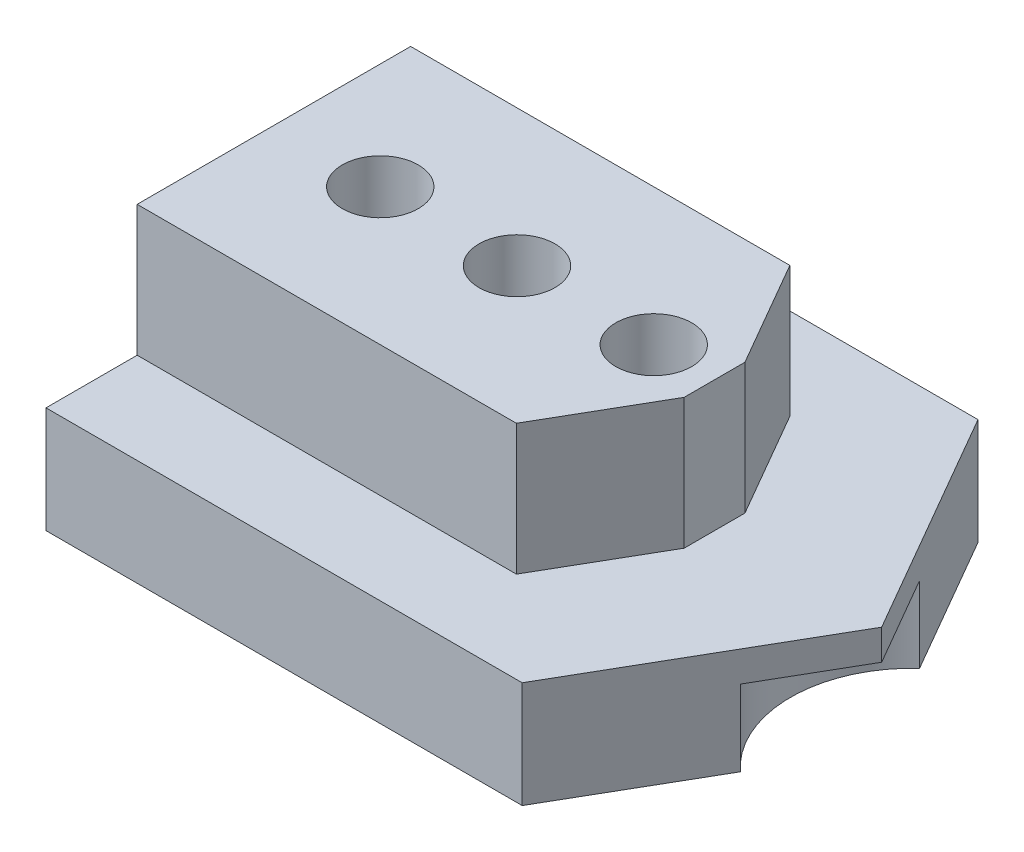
ISO-10303-21;
HEADER;
FILE_DESCRIPTION(('STEP AP214'),'2;1');
FILE_NAME('part.step','',(''),(''),'','','');
FILE_SCHEMA(('AUTOMOTIVE_DESIGN { 1 0 10303 214 1 1 1 1 }'));
ENDSEC;
DATA;
#1=APPLICATION_CONTEXT('core data for automotive mechanical design processes');
#2=APPLICATION_PROTOCOL_DEFINITION('international standard','automotive_design',2000,#1);
#3=PRODUCT_CONTEXT('',#1,'mechanical');
#4=PRODUCT('Part','Part','',(#3));
#5=PRODUCT_RELATED_PRODUCT_CATEGORY('part','',(#4));
#6=PRODUCT_DEFINITION_FORMATION('','',#4);
#7=PRODUCT_DEFINITION_CONTEXT('part definition',#1,'design');
#8=PRODUCT_DEFINITION('design','',#6,#7);
#9=PRODUCT_DEFINITION_SHAPE('','',#8);
#10=(LENGTH_UNIT() NAMED_UNIT(*) SI_UNIT(.MILLI.,.METRE.));
#11=(NAMED_UNIT(*) PLANE_ANGLE_UNIT() SI_UNIT($,.RADIAN.));
#12=(NAMED_UNIT(*) SI_UNIT($,.STERADIAN.) SOLID_ANGLE_UNIT());
#13=UNCERTAINTY_MEASURE_WITH_UNIT(LENGTH_MEASURE(1.E-05),#10,'distance_accuracy_value','');
#14=(GEOMETRIC_REPRESENTATION_CONTEXT(3) GLOBAL_UNCERTAINTY_ASSIGNED_CONTEXT((#13)) GLOBAL_UNIT_ASSIGNED_CONTEXT((#10,
#11,#12)) REPRESENTATION_CONTEXT('',''));
#15=CARTESIAN_POINT('',(0.,0.,0.));
#16=DIRECTION('',(0.,0.,1.));
#17=DIRECTION('',(1.,0.,0.));
#18=AXIS2_PLACEMENT_3D('',#15,#16,#17);
#19=CARTESIAN_POINT('',(0.,3.5,7.49999999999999));
#20=DIRECTION('',(0.,-1.,0.));
#21=DIRECTION('',(0.,0.,-1.));
#22=AXIS2_PLACEMENT_3D('',#19,#20,#21);
#23=PLANE('',#22);
#24=DIRECTION('',(-1.,0.,0.));
#25=VECTOR('',#24,1.);
#26=CARTESIAN_POINT('',(0.,3.50000000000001,-4.50000000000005));
#27=LINE('',#26,#25);
#28=CARTESIAN_POINT('',(12.4792740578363,3.5,-4.50000000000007));
#29=VERTEX_POINT('',#28);
#30=CARTESIAN_POINT('',(0.,3.50000000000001,-4.50000000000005));
#31=VERTEX_POINT('',#30);
#32=EDGE_CURVE('E531',#29,#31,#27,.T.);
#33=ORIENTED_EDGE('',*,*,#32,.F.);
#34=DIRECTION('',(-0.500000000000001,0.,-0.866025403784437));
#35=VECTOR('',#34,1.);
#36=CARTESIAN_POINT('',(12.4792740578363,3.5,-4.50000000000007));
#37=LINE('',#36,#35);
#38=CARTESIAN_POINT('',(14.5,3.5,-1.00000000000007));
#39=VERTEX_POINT('',#38);
#40=EDGE_CURVE('E528',#39,#29,#37,.T.);
#41=ORIENTED_EDGE('',*,*,#40,.F.);
#42=DIRECTION('',(0.,0.,-1.));
#43=VECTOR('',#42,1.);
#44=CARTESIAN_POINT('',(14.5,3.5,-1.00000000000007));
#45=LINE('',#44,#43);
#46=CARTESIAN_POINT('',(14.5,3.5,0.999999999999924));
#47=VERTEX_POINT('',#46);
#48=EDGE_CURVE('E525',#47,#39,#45,.T.);
#49=ORIENTED_EDGE('',*,*,#48,.F.);
#50=DIRECTION('',(0.500000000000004,0.,-0.86602540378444));
#51=VECTOR('',#50,1.);
#52=CARTESIAN_POINT('',(14.5,3.5,0.999999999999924));
#53=LINE('',#52,#51);
#54=CARTESIAN_POINT('',(12.4792740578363,3.5,4.49999999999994));
#55=VERTEX_POINT('',#54);
#56=EDGE_CURVE('E522',#55,#47,#53,.T.);
#57=ORIENTED_EDGE('',*,*,#56,.F.);
#58=DIRECTION('',(1.,0.,0.));
#59=VECTOR('',#58,1.);
#60=CARTESIAN_POINT('',(0.,3.5,4.49999999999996));
#61=LINE('',#60,#59);
#62=CARTESIAN_POINT('',(0.,3.5,4.49999999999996));
#63=VERTEX_POINT('',#62);
#64=EDGE_CURVE('E521',#63,#55,#61,.T.);
#65=ORIENTED_EDGE('',*,*,#64,.F.);
#66=DIRECTION('',(0.,0.,1.));
#67=VECTOR('',#66,1.);
#68=CARTESIAN_POINT('',(0.,3.5,7.49999999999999));
#69=LINE('',#68,#67);
#70=CARTESIAN_POINT('',(0.,3.5,7.49999999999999));
#71=VERTEX_POINT('',#70);
#72=EDGE_CURVE('E594',#63,#71,#69,.T.);
#73=ORIENTED_EDGE('',*,*,#72,.T.);
#74=DIRECTION('',(1.,0.,0.));
#75=VECTOR('',#74,1.);
#76=CARTESIAN_POINT('',(15.6698729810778,3.49999999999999,7.49999999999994));
#77=LINE('',#76,#75);
#78=CARTESIAN_POINT('',(15.6698729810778,3.49999999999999,7.49999999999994));
#79=VERTEX_POINT('',#78);
#80=EDGE_CURVE('E585',#71,#79,#77,.T.);
#81=ORIENTED_EDGE('',*,*,#80,.T.);
#82=DIRECTION('',(0.500000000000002,0.,-0.866025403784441));
#83=VECTOR('',#82,1.);
#84=CARTESIAN_POINT('',(20.,3.5,0.));
#85=LINE('',#84,#83);
#86=CARTESIAN_POINT('',(20.,3.5,0.));
#87=VERTEX_POINT('',#86);
#88=EDGE_CURVE('E588',#79,#87,#85,.T.);
#89=ORIENTED_EDGE('',*,*,#88,.T.);
#90=DIRECTION('',(-0.499999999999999,0.,-0.866025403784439));
#91=VECTOR('',#90,1.);
#92=CARTESIAN_POINT('',(15.6698729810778,3.5,-7.50000000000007));
#93=LINE('',#92,#91);
#94=CARTESIAN_POINT('',(15.6698729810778,3.5,-7.50000000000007));
#95=VERTEX_POINT('',#94);
#96=EDGE_CURVE('E590',#87,#95,#93,.T.);
#97=ORIENTED_EDGE('',*,*,#96,.T.);
#98=DIRECTION('',(-1.,0.,0.));
#99=VECTOR('',#98,1.);
#100=CARTESIAN_POINT('',(0.,3.50000000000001,-7.50000000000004));
#101=LINE('',#100,#99);
#102=CARTESIAN_POINT('',(0.,3.50000000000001,-7.50000000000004));
#103=VERTEX_POINT('',#102);
#104=EDGE_CURVE('E592',#95,#103,#101,.T.);
#105=ORIENTED_EDGE('',*,*,#104,.T.);
#106=EDGE_CURVE('E603',#103,#31,#69,.T.);
#107=ORIENTED_EDGE('',*,*,#106,.T.);
#108=EDGE_LOOP('',(#33,#41,#49,#57,#65,#73,#81,#89,#97,#105,#107));
#109=FACE_BOUND('',#108,.T.);
#110=ADVANCED_FACE('F350',(#109),#23,.F.);
#111=CARTESIAN_POINT('',(15.6698729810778,3.49999999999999,7.49999999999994));
#112=DIRECTION('',(0.,0.,-1.));
#113=DIRECTION('',(-1.,0.,0.));
#114=AXIS2_PLACEMENT_3D('',#111,#112,#113);
#115=PLANE('',#114);
#116=DIRECTION('',(1.,0.,0.));
#117=VECTOR('',#116,1.);
#118=CARTESIAN_POINT('',(15.6698729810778,0.,7.49999999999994));
#119=LINE('',#118,#117);
#120=CARTESIAN_POINT('',(0.,0.,7.5));
#121=VERTEX_POINT('',#120);
#122=CARTESIAN_POINT('',(15.6698729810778,0.,7.49999999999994));
#123=VERTEX_POINT('',#122);
#124=EDGE_CURVE('E573',#121,#123,#119,.T.);
#125=ORIENTED_EDGE('',*,*,#124,.T.);
#126=DIRECTION('',(0.,-1.,0.));
#127=VECTOR('',#126,1.);
#128=CARTESIAN_POINT('',(15.6698729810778,3.49999999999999,7.49999999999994));
#129=LINE('',#128,#127);
#130=EDGE_CURVE('E359',#79,#123,#129,.T.);
#131=ORIENTED_EDGE('',*,*,#130,.F.);
#132=ORIENTED_EDGE('',*,*,#80,.F.);
#133=DIRECTION('',(0.,-1.,0.));
#134=VECTOR('',#133,1.);
#135=CARTESIAN_POINT('',(0.,3.5,7.49999999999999));
#136=LINE('',#135,#134);
#137=EDGE_CURVE('E597',#71,#121,#136,.T.);
#138=ORIENTED_EDGE('',*,*,#137,.T.);
#139=EDGE_LOOP('',(#125,#131,#132,#138));
#140=FACE_BOUND('',#139,.T.);
#141=ADVANCED_FACE('F352',(#140),#115,.F.);
#142=CARTESIAN_POINT('',(20.,3.5,0.));
#143=DIRECTION('',(-0.86602540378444,0.,-0.499999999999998));
#144=DIRECTION('',(-0.500000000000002,0.,0.866025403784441));
#145=AXIS2_PLACEMENT_3D('',#142,#143,#144);
#146=PLANE('',#145);
#147=DIRECTION('',(0.500000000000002,0.,-0.866025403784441));
#148=VECTOR('',#147,1.);
#149=CARTESIAN_POINT('',(20.,0.,0.));
#150=LINE('',#149,#148);
#151=CARTESIAN_POINT('',(18.2974375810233,0.,2.9489246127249));
#152=VERTEX_POINT('',#151);
#153=EDGE_CURVE('E576',#123,#152,#150,.T.);
#154=ORIENTED_EDGE('',*,*,#153,.T.);
#155=DIRECTION('',(0.,-1.,0.));
#156=VECTOR('',#155,1.);
#157=CARTESIAN_POINT('',(18.2974375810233,2.5,2.9489246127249));
#158=LINE('',#157,#156);
#159=CARTESIAN_POINT('',(18.2974375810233,2.5,2.9489246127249));
#160=VERTEX_POINT('',#159);
#161=EDGE_CURVE('E374',#152,#160,#158,.F.);
#162=ORIENTED_EDGE('',*,*,#161,.T.);
#163=DIRECTION('',(-0.500000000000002,0.,0.866025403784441));
#164=VECTOR('',#163,1.);
#165=CARTESIAN_POINT('',(20.,2.5,0.));
#166=LINE('',#165,#164);
#167=CARTESIAN_POINT('',(20.,2.5,0.));
#168=VERTEX_POINT('',#167);
#169=EDGE_CURVE('E519',#168,#160,#166,.T.);
#170=ORIENTED_EDGE('',*,*,#169,.F.);
#171=DIRECTION('',(0.,-1.,0.));
#172=VECTOR('',#171,1.);
#173=CARTESIAN_POINT('',(20.,3.5,0.));
#174=LINE('',#173,#172);
#175=EDGE_CURVE('E607',#87,#168,#174,.T.);
#176=ORIENTED_EDGE('',*,*,#175,.F.);
#177=ORIENTED_EDGE('',*,*,#88,.F.);
#178=ORIENTED_EDGE('',*,*,#130,.T.);
#179=EDGE_LOOP('',(#154,#162,#170,#176,#177,#178));
#180=FACE_BOUND('',#179,.T.);
#181=ADVANCED_FACE('F626',(#180),#146,.F.);
#182=CARTESIAN_POINT('',(15.6698729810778,3.5,-7.50000000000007));
#183=DIRECTION('',(-0.866025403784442,0.,0.500000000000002));
#184=DIRECTION('',(0.499999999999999,0.,0.866025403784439));
#185=AXIS2_PLACEMENT_3D('',#182,#183,#184);
#186=PLANE('',#185);
#187=DIRECTION('',(0.499999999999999,0.,0.866025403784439));
#188=VECTOR('',#187,1.);
#189=CARTESIAN_POINT('',(15.6698729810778,2.5,-7.50000000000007));
#190=LINE('',#189,#188);
#191=CARTESIAN_POINT('',(18.2974375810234,2.5,-2.94892461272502));
#192=VERTEX_POINT('',#191);
#193=EDGE_CURVE('E11',#192,#168,#190,.T.);
#194=ORIENTED_EDGE('',*,*,#193,.F.);
#195=DIRECTION('',(0.,-1.,0.));
#196=VECTOR('',#195,1.);
#197=CARTESIAN_POINT('',(18.2974375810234,2.5,-2.94892461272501));
#198=LINE('',#197,#196);
#199=CARTESIAN_POINT('',(18.2974375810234,0.,-2.94892461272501));
#200=VERTEX_POINT('',#199);
#201=EDGE_CURVE('E515',#192,#200,#198,.T.);
#202=ORIENTED_EDGE('',*,*,#201,.T.);
#203=DIRECTION('',(-0.499999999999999,0.,-0.866025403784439));
#204=VECTOR('',#203,1.);
#205=CARTESIAN_POINT('',(15.6698729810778,0.,-7.50000000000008));
#206=LINE('',#205,#204);
#207=CARTESIAN_POINT('',(15.6698729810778,0.,-7.50000000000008));
#208=VERTEX_POINT('',#207);
#209=EDGE_CURVE('E579',#200,#208,#206,.T.);
#210=ORIENTED_EDGE('',*,*,#209,.T.);
#211=DIRECTION('',(0.,-1.,0.));
#212=VECTOR('',#211,1.);
#213=CARTESIAN_POINT('',(15.6698729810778,3.5,-7.50000000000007));
#214=LINE('',#213,#212);
#215=EDGE_CURVE('E610',#95,#208,#214,.T.);
#216=ORIENTED_EDGE('',*,*,#215,.F.);
#217=ORIENTED_EDGE('',*,*,#96,.F.);
#218=ORIENTED_EDGE('',*,*,#175,.T.);
#219=EDGE_LOOP('',(#194,#202,#210,#216,#217,#218));
#220=FACE_BOUND('',#219,.T.);
#221=ADVANCED_FACE('F676',(#220),#186,.F.);
#222=CARTESIAN_POINT('',(0.,3.50000000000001,-7.50000000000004));
#223=DIRECTION('',(0.,0.,1.));
#224=DIRECTION('',(1.,0.,0.));
#225=AXIS2_PLACEMENT_3D('',#222,#223,#224);
#226=PLANE('',#225);
#227=DIRECTION('',(-1.,0.,0.));
#228=VECTOR('',#227,1.);
#229=CARTESIAN_POINT('',(0.,0.,-7.50000000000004));
#230=LINE('',#229,#228);
#231=CARTESIAN_POINT('',(0.,0.,-7.50000000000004));
#232=VERTEX_POINT('',#231);
#233=EDGE_CURVE('E581',#208,#232,#230,.T.);
#234=ORIENTED_EDGE('',*,*,#233,.T.);
#235=DIRECTION('',(0.,-1.,0.));
#236=VECTOR('',#235,1.);
#237=CARTESIAN_POINT('',(0.,3.50000000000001,-7.50000000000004));
#238=LINE('',#237,#236);
#239=EDGE_CURVE('E612',#103,#232,#238,.T.);
#240=ORIENTED_EDGE('',*,*,#239,.F.);
#241=ORIENTED_EDGE('',*,*,#104,.F.);
#242=ORIENTED_EDGE('',*,*,#215,.T.);
#243=EDGE_LOOP('',(#234,#240,#241,#242));
#244=FACE_BOUND('',#243,.T.);
#245=ADVANCED_FACE('F673',(#244),#226,.F.);
#246=CARTESIAN_POINT('',(0.,3.5,7.49999999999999));
#247=DIRECTION('',(1.,0.,0.));
#248=DIRECTION('',(0.,0.,-1.));
#249=AXIS2_PLACEMENT_3D('',#246,#247,#248);
#250=PLANE('',#249);
#251=DIRECTION('',(0.,0.,1.));
#252=VECTOR('',#251,1.);
#253=CARTESIAN_POINT('',(0.,0.,7.5));
#254=LINE('',#253,#252);
#255=EDGE_CURVE('E583',#232,#121,#254,.T.);
#256=ORIENTED_EDGE('',*,*,#255,.T.);
#257=ORIENTED_EDGE('',*,*,#137,.F.);
#258=ORIENTED_EDGE('',*,*,#72,.F.);
#259=DIRECTION('',(0.,-1.,0.));
#260=VECTOR('',#259,1.);
#261=CARTESIAN_POINT('',(0.,7.8,4.49999999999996));
#262=LINE('',#261,#260);
#263=CARTESIAN_POINT('',(0.,7.8,4.49999999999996));
#264=VERTEX_POINT('',#263);
#265=EDGE_CURVE('E572',#264,#63,#262,.T.);
#266=ORIENTED_EDGE('',*,*,#265,.F.);
#267=DIRECTION('',(0.,0.,1.));
#268=VECTOR('',#267,1.);
#269=CARTESIAN_POINT('',(0.,7.8,-4.50000000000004));
#270=LINE('',#269,#268);
#271=CARTESIAN_POINT('',(0.,7.8,-4.50000000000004));
#272=VERTEX_POINT('',#271);
#273=EDGE_CURVE('E534',#272,#264,#270,.T.);
#274=ORIENTED_EDGE('',*,*,#273,.F.);
#275=DIRECTION('',(0.,-1.,0.));
#276=VECTOR('',#275,1.);
#277=CARTESIAN_POINT('',(0.,7.8,-4.50000000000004));
#278=LINE('',#277,#276);
#279=EDGE_CURVE('E542',#272,#31,#278,.T.);
#280=ORIENTED_EDGE('',*,*,#279,.T.);
#281=ORIENTED_EDGE('',*,*,#106,.F.);
#282=ORIENTED_EDGE('',*,*,#239,.T.);
#283=EDGE_LOOP('',(#256,#257,#258,#266,#274,#280,#281,#282));
#284=FACE_BOUND('',#283,.T.);
#285=ADVANCED_FACE('F634',(#284),#250,.F.);
#286=CARTESIAN_POINT('',(0.,0.,7.5));
#287=DIRECTION('',(0.,-1.,0.));
#288=DIRECTION('',(0.,0.,-1.));
#289=AXIS2_PLACEMENT_3D('',#286,#287,#288);
#290=PLANE('',#289);
#291=CARTESIAN_POINT('',(12.5,0.,0.));
#292=DIRECTION('',(0.,1.,0.));
#293=DIRECTION('',(0.,0.,1.));
#294=AXIS2_PLACEMENT_3D('',#291,#292,#293);
#295=CIRCLE('',#294,1.25);
#296=CARTESIAN_POINT('',(12.5,0.,1.24999999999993));
#297=VERTEX_POINT('',#296);
#298=EDGE_CURVE('E702',#297,#297,#295,.T.);
#299=ORIENTED_EDGE('',*,*,#298,.T.);
#300=EDGE_LOOP('',(#299));
#301=FACE_BOUND('',#300,.T.);
#302=CARTESIAN_POINT('',(3.50000000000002,0.,0.));
#303=DIRECTION('',(0.,1.,0.));
#304=DIRECTION('',(0.,0.,1.));
#305=AXIS2_PLACEMENT_3D('',#302,#303,#304);
#306=CIRCLE('',#305,1.25);
#307=CARTESIAN_POINT('',(3.50000000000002,0.,1.24999999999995));
#308=VERTEX_POINT('',#307);
#309=EDGE_CURVE('E705',#308,#308,#306,.T.);
#310=ORIENTED_EDGE('',*,*,#309,.T.);
#311=EDGE_LOOP('',(#310));
#312=FACE_BOUND('',#311,.T.);
#313=CARTESIAN_POINT('',(8.20000000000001,0.,3.39999999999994));
#314=DIRECTION('',(0.,-1.,0.));
#315=DIRECTION('',(0.,0.,-1.));
#316=AXIS2_PLACEMENT_3D('',#313,#314,#315);
#317=CIRCLE('',#316,2.);
#318=CARTESIAN_POINT('',(10.2,0.,3.39999999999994));
#319=VERTEX_POINT('',#318);
#320=CARTESIAN_POINT('',(6.2,0.,3.39999999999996));
#321=VERTEX_POINT('',#320);
#322=EDGE_CURVE('E366',#319,#321,#317,.T.);
#323=ORIENTED_EDGE('',*,*,#322,.F.);
#324=DIRECTION('',(0.,0.,1.));
#325=VECTOR('',#324,1.);
#326=CARTESIAN_POINT('',(10.2,0.,3.39999999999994));
#327=LINE('',#326,#325);
#328=CARTESIAN_POINT('',(10.2,0.,-3.40000000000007));
#329=VERTEX_POINT('',#328);
#330=EDGE_CURVE('E492',#329,#319,#327,.T.);
#331=ORIENTED_EDGE('',*,*,#330,.F.);
#332=CARTESIAN_POINT('',(8.2,0.,-3.40000000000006));
#333=DIRECTION('',(0.,-1.,0.));
#334=DIRECTION('',(0.,0.,1.));
#335=AXIS2_PLACEMENT_3D('',#332,#333,#334);
#336=CIRCLE('',#335,2.);
#337=CARTESIAN_POINT('',(6.19999999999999,0.,-3.40000000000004));
#338=VERTEX_POINT('',#337);
#339=EDGE_CURVE('E474',#338,#329,#336,.T.);
#340=ORIENTED_EDGE('',*,*,#339,.F.);
#341=DIRECTION('',(0.,0.,-1.));
#342=VECTOR('',#341,1.);
#343=CARTESIAN_POINT('',(6.2,0.,-3.40000000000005));
#344=LINE('',#343,#342);
#345=EDGE_CURVE('E485',#321,#338,#344,.T.);
#346=ORIENTED_EDGE('',*,*,#345,.F.);
#347=EDGE_LOOP('',(#323,#331,#340,#346));
#348=FACE_BOUND('',#347,.T.);
#349=CARTESIAN_POINT('',(21.,0.,0.));
#350=DIRECTION('',(0.,-1.,0.));
#351=DIRECTION('',(0.,0.,-1.));
#352=AXIS2_PLACEMENT_3D('',#349,#350,#351);
#353=CIRCLE('',#352,4.);
#354=EDGE_CURVE('E508',#152,#200,#353,.T.);
#355=ORIENTED_EDGE('',*,*,#354,.F.);
#356=ORIENTED_EDGE('',*,*,#153,.F.);
#357=ORIENTED_EDGE('',*,*,#124,.F.);
#358=ORIENTED_EDGE('',*,*,#255,.F.);
#359=ORIENTED_EDGE('',*,*,#233,.F.);
#360=ORIENTED_EDGE('',*,*,#209,.F.);
#361=EDGE_LOOP('',(#355,#356,#357,#358,#359,#360));
#362=FACE_BOUND('',#361,.T.);
#363=ADVANCED_FACE('F489',(#301,#312,#348,#362),#290,.T.);
#364=CARTESIAN_POINT('',(0.,7.8,4.49999999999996));
#365=DIRECTION('',(0.,0.,-1.));
#366=DIRECTION('',(-1.,0.,0.));
#367=AXIS2_PLACEMENT_3D('',#364,#365,#366);
#368=PLANE('',#367);
#369=ORIENTED_EDGE('',*,*,#64,.T.);
#370=DIRECTION('',(0.,-1.,0.));
#371=VECTOR('',#370,1.);
#372=CARTESIAN_POINT('',(12.4792740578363,7.8,4.49999999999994));
#373=LINE('',#372,#371);
#374=CARTESIAN_POINT('',(12.4792740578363,7.8,4.49999999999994));
#375=VERTEX_POINT('',#374);
#376=EDGE_CURVE('E569',#375,#55,#373,.T.);
#377=ORIENTED_EDGE('',*,*,#376,.F.);
#378=DIRECTION('',(1.,0.,0.));
#379=VECTOR('',#378,1.);
#380=CARTESIAN_POINT('',(0.,7.8,4.49999999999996));
#381=LINE('',#380,#379);
#382=EDGE_CURVE('E638',#264,#375,#381,.T.);
#383=ORIENTED_EDGE('',*,*,#382,.F.);
#384=ORIENTED_EDGE('',*,*,#265,.T.);
#385=EDGE_LOOP('',(#369,#377,#383,#384));
#386=FACE_BOUND('',#385,.T.);
#387=ADVANCED_FACE('F636',(#386),#368,.F.);
#388=CARTESIAN_POINT('',(14.5,7.8,0.99999999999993));
#389=DIRECTION('',(-0.866025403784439,0.,-0.5));
#390=DIRECTION('',(-0.500000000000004,0.,0.86602540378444));
#391=AXIS2_PLACEMENT_3D('',#388,#389,#390);
#392=PLANE('',#391);
#393=ORIENTED_EDGE('',*,*,#56,.T.);
#394=DIRECTION('',(0.,-1.,0.));
#395=VECTOR('',#394,1.);
#396=CARTESIAN_POINT('',(14.5,7.8,0.99999999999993));
#397=LINE('',#396,#395);
#398=CARTESIAN_POINT('',(14.5,7.8,0.99999999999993));
#399=VERTEX_POINT('',#398);
#400=EDGE_CURVE('E566',#399,#47,#397,.T.);
#401=ORIENTED_EDGE('',*,*,#400,.F.);
#402=DIRECTION('',(0.500000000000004,0.,-0.86602540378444));
#403=VECTOR('',#402,1.);
#404=CARTESIAN_POINT('',(14.5,7.8,0.99999999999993));
#405=LINE('',#404,#403);
#406=EDGE_CURVE('E642',#375,#399,#405,.T.);
#407=ORIENTED_EDGE('',*,*,#406,.F.);
#408=ORIENTED_EDGE('',*,*,#376,.T.);
#409=EDGE_LOOP('',(#393,#401,#407,#408));
#410=FACE_BOUND('',#409,.T.);
#411=ADVANCED_FACE('F698',(#410),#392,.F.);
#412=CARTESIAN_POINT('',(14.5,7.8,-1.00000000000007));
#413=DIRECTION('',(-1.,0.,0.));
#414=DIRECTION('',(0.,0.,1.));
#415=AXIS2_PLACEMENT_3D('',#412,#413,#414);
#416=PLANE('',#415);
#417=ORIENTED_EDGE('',*,*,#48,.T.);
#418=DIRECTION('',(0.,-1.,0.));
#419=VECTOR('',#418,1.);
#420=CARTESIAN_POINT('',(14.5,7.8,-1.00000000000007));
#421=LINE('',#420,#419);
#422=CARTESIAN_POINT('',(14.5,7.8,-1.00000000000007));
#423=VERTEX_POINT('',#422);
#424=EDGE_CURVE('E553',#423,#39,#421,.T.);
#425=ORIENTED_EDGE('',*,*,#424,.F.);
#426=DIRECTION('',(0.,0.,-1.));
#427=VECTOR('',#426,1.);
#428=CARTESIAN_POINT('',(14.5,7.8,-1.00000000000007));
#429=LINE('',#428,#427);
#430=EDGE_CURVE('E560',#399,#423,#429,.T.);
#431=ORIENTED_EDGE('',*,*,#430,.F.);
#432=ORIENTED_EDGE('',*,*,#400,.T.);
#433=EDGE_LOOP('',(#417,#425,#431,#432));
#434=FACE_BOUND('',#433,.T.);
#435=ADVANCED_FACE('F756',(#434),#416,.F.);
#436=CARTESIAN_POINT('',(12.4792740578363,7.8,-4.50000000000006));
#437=DIRECTION('',(-0.866025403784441,0.,0.500000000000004));
#438=DIRECTION('',(0.500000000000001,0.,0.866025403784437));
#439=AXIS2_PLACEMENT_3D('',#436,#437,#438);
#440=PLANE('',#439);
#441=ORIENTED_EDGE('',*,*,#40,.T.);
#442=DIRECTION('',(0.,-1.,0.));
#443=VECTOR('',#442,1.);
#444=CARTESIAN_POINT('',(12.4792740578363,7.8,-4.50000000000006));
#445=LINE('',#444,#443);
#446=CARTESIAN_POINT('',(12.4792740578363,7.8,-4.50000000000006));
#447=VERTEX_POINT('',#446);
#448=EDGE_CURVE('E545',#447,#29,#445,.T.);
#449=ORIENTED_EDGE('',*,*,#448,.F.);
#450=DIRECTION('',(-0.500000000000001,0.,-0.866025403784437));
#451=VECTOR('',#450,1.);
#452=CARTESIAN_POINT('',(12.4792740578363,7.8,-4.50000000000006));
#453=LINE('',#452,#451);
#454=EDGE_CURVE('E555',#423,#447,#453,.T.);
#455=ORIENTED_EDGE('',*,*,#454,.F.);
#456=ORIENTED_EDGE('',*,*,#424,.T.);
#457=EDGE_LOOP('',(#441,#449,#455,#456));
#458=FACE_BOUND('',#457,.T.);
#459=ADVANCED_FACE('F656',(#458),#440,.F.);
#460=CARTESIAN_POINT('',(0.,7.8,-4.50000000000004));
#461=DIRECTION('',(0.,0.,1.));
#462=DIRECTION('',(1.,0.,0.));
#463=AXIS2_PLACEMENT_3D('',#460,#461,#462);
#464=PLANE('',#463);
#465=ORIENTED_EDGE('',*,*,#32,.T.);
#466=ORIENTED_EDGE('',*,*,#279,.F.);
#467=DIRECTION('',(-1.,0.,0.));
#468=VECTOR('',#467,1.);
#469=CARTESIAN_POINT('',(0.,7.8,-4.50000000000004));
#470=LINE('',#469,#468);
#471=EDGE_CURVE('E546',#447,#272,#470,.T.);
#472=ORIENTED_EDGE('',*,*,#471,.F.);
#473=ORIENTED_EDGE('',*,*,#448,.T.);
#474=EDGE_LOOP('',(#465,#466,#472,#473));
#475=FACE_BOUND('',#474,.T.);
#476=ADVANCED_FACE('F646',(#475),#464,.F.);
#477=CARTESIAN_POINT('',(0.,7.8,4.49999999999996));
#478=DIRECTION('',(0.,1.,0.));
#479=DIRECTION('',(0.,0.,1.));
#480=AXIS2_PLACEMENT_3D('',#477,#478,#479);
#481=PLANE('',#480);
#482=CARTESIAN_POINT('',(7.99999999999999,7.8,0.));
#483=DIRECTION('',(0.,1.,0.));
#484=DIRECTION('',(0.,0.,1.));
#485=AXIS2_PLACEMENT_3D('',#482,#483,#484);
#486=CIRCLE('',#485,1.24999999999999);
#487=CARTESIAN_POINT('',(7.99999999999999,7.8,1.24999999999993));
#488=VERTEX_POINT('',#487);
#489=EDGE_CURVE('E716',#488,#488,#486,.T.);
#490=ORIENTED_EDGE('',*,*,#489,.F.);
#491=EDGE_LOOP('',(#490));
#492=FACE_BOUND('',#491,.T.);
#493=CARTESIAN_POINT('',(12.5,7.8,0.));
#494=DIRECTION('',(0.,1.,0.));
#495=DIRECTION('',(0.,0.,1.));
#496=AXIS2_PLACEMENT_3D('',#493,#494,#495);
#497=CIRCLE('',#496,1.25);
#498=CARTESIAN_POINT('',(12.5,7.8,1.24999999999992));
#499=VERTEX_POINT('',#498);
#500=EDGE_CURVE('E713',#499,#499,#497,.T.);
#501=ORIENTED_EDGE('',*,*,#500,.F.);
#502=EDGE_LOOP('',(#501));
#503=FACE_BOUND('',#502,.T.);
#504=CARTESIAN_POINT('',(3.50000000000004,7.8,0.));
#505=DIRECTION('',(0.,1.,0.));
#506=DIRECTION('',(0.,0.,1.));
#507=AXIS2_PLACEMENT_3D('',#504,#505,#506);
#508=CIRCLE('',#507,1.25);
#509=CARTESIAN_POINT('',(3.50000000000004,7.8,1.24999999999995));
#510=VERTEX_POINT('',#509);
#511=EDGE_CURVE('E707',#510,#510,#508,.T.);
#512=ORIENTED_EDGE('',*,*,#511,.F.);
#513=EDGE_LOOP('',(#512));
#514=FACE_BOUND('',#513,.T.);
#515=ORIENTED_EDGE('',*,*,#273,.T.);
#516=ORIENTED_EDGE('',*,*,#382,.T.);
#517=ORIENTED_EDGE('',*,*,#406,.T.);
#518=ORIENTED_EDGE('',*,*,#430,.T.);
#519=ORIENTED_EDGE('',*,*,#454,.T.);
#520=ORIENTED_EDGE('',*,*,#471,.T.);
#521=EDGE_LOOP('',(#515,#516,#517,#518,#519,#520));
#522=FACE_BOUND('',#521,.T.);
#523=ADVANCED_FACE('F643',(#492,#503,#514,#522),#481,.T.);
#524=CARTESIAN_POINT('',(21.,2.5,0.));
#525=DIRECTION('',(0.,-1.,0.));
#526=DIRECTION('',(0.,0.,-1.));
#527=AXIS2_PLACEMENT_3D('',#524,#525,#526);
#528=PLANE('',#527);
#529=ORIENTED_EDGE('',*,*,#169,.T.);
#530=CARTESIAN_POINT('',(21.,2.5,0.));
#531=DIRECTION('',(0.,-1.,0.));
#532=DIRECTION('',(0.,0.,-1.));
#533=AXIS2_PLACEMENT_3D('',#530,#531,#532);
#534=CIRCLE('',#533,4.);
#535=EDGE_CURVE('E512',#160,#192,#534,.T.);
#536=ORIENTED_EDGE('',*,*,#535,.T.);
#537=ORIENTED_EDGE('',*,*,#193,.T.);
#538=EDGE_LOOP('',(#529,#536,#537));
#539=FACE_BOUND('',#538,.T.);
#540=ADVANCED_FACE('F645',(#539),#528,.T.);
#541=CARTESIAN_POINT('',(21.,2.5,0.));
#542=DIRECTION('',(0.,-1.,0.));
#543=DIRECTION('',(0.,0.,-1.));
#544=AXIS2_PLACEMENT_3D('',#541,#542,#543);
#545=CYLINDRICAL_SURFACE('',#544,4.);
#546=ORIENTED_EDGE('',*,*,#354,.T.);
#547=ORIENTED_EDGE('',*,*,#201,.F.);
#548=ORIENTED_EDGE('',*,*,#535,.F.);
#549=ORIENTED_EDGE('',*,*,#161,.F.);
#550=EDGE_LOOP('',(#546,#547,#548,#549));
#551=FACE_BOUND('',#550,.T.);
#552=ADVANCED_FACE('F653',(#551),#545,.F.);
#553=CARTESIAN_POINT('',(8.20000000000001,3.1,3.39999999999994));
#554=DIRECTION('',(0.,-1.,0.));
#555=DIRECTION('',(0.,0.,-1.));
#556=AXIS2_PLACEMENT_3D('',#553,#554,#555);
#557=CYLINDRICAL_SURFACE('',#556,2.);
#558=ORIENTED_EDGE('',*,*,#322,.T.);
#559=DIRECTION('',(0.,-1.,0.));
#560=VECTOR('',#559,1.);
#561=CARTESIAN_POINT('',(6.19999999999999,3.1,3.39999999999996));
#562=LINE('',#561,#560);
#563=CARTESIAN_POINT('',(6.19999999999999,3.1,3.39999999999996));
#564=VERTEX_POINT('',#563);
#565=EDGE_CURVE('E482',#564,#321,#562,.T.);
#566=ORIENTED_EDGE('',*,*,#565,.F.);
#567=CARTESIAN_POINT('',(8.20000000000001,3.1,3.39999999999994));
#568=DIRECTION('',(0.,-1.,0.));
#569=DIRECTION('',(0.,0.,-1.));
#570=AXIS2_PLACEMENT_3D('',#567,#568,#569);
#571=CIRCLE('',#570,2.);
#572=CARTESIAN_POINT('',(10.2,3.1,3.39999999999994));
#573=VERTEX_POINT('',#572);
#574=EDGE_CURVE('E494',#573,#564,#571,.T.);
#575=ORIENTED_EDGE('',*,*,#574,.F.);
#576=DIRECTION('',(0.,-1.,0.));
#577=VECTOR('',#576,1.);
#578=CARTESIAN_POINT('',(10.2,3.1,3.39999999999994));
#579=LINE('',#578,#577);
#580=EDGE_CURVE('E506',#573,#319,#579,.T.);
#581=ORIENTED_EDGE('',*,*,#580,.T.);
#582=EDGE_LOOP('',(#558,#566,#575,#581));
#583=FACE_BOUND('',#582,.T.);
#584=ADVANCED_FACE('F731',(#583),#557,.F.);
#585=CARTESIAN_POINT('',(10.2,3.1,3.39999999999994));
#586=DIRECTION('',(1.,0.,0.));
#587=DIRECTION('',(0.,0.,-1.));
#588=AXIS2_PLACEMENT_3D('',#585,#586,#587);
#589=PLANE('',#588);
#590=ORIENTED_EDGE('',*,*,#330,.T.);
#591=ORIENTED_EDGE('',*,*,#580,.F.);
#592=DIRECTION('',(0.,0.,1.));
#593=VECTOR('',#592,1.);
#594=CARTESIAN_POINT('',(10.2,3.1,3.39999999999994));
#595=LINE('',#594,#593);
#596=CARTESIAN_POINT('',(10.2,3.1,-3.40000000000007));
#597=VERTEX_POINT('',#596);
#598=EDGE_CURVE('E503',#597,#573,#595,.T.);
#599=ORIENTED_EDGE('',*,*,#598,.F.);
#600=DIRECTION('',(0.,-1.,0.));
#601=VECTOR('',#600,1.);
#602=CARTESIAN_POINT('',(10.2,3.1,-3.40000000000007));
#603=LINE('',#602,#601);
#604=EDGE_CURVE('E481',#597,#329,#603,.T.);
#605=ORIENTED_EDGE('',*,*,#604,.T.);
#606=EDGE_LOOP('',(#590,#591,#599,#605));
#607=FACE_BOUND('',#606,.T.);
#608=ADVANCED_FACE('F733',(#607),#589,.F.);
#609=CARTESIAN_POINT('',(8.20000000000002,3.1,-3.40000000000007));
#610=DIRECTION('',(0.,-1.,0.));
#611=DIRECTION('',(0.,0.,-1.));
#612=AXIS2_PLACEMENT_3D('',#609,#610,#611);
#613=CYLINDRICAL_SURFACE('',#612,2.);
#614=ORIENTED_EDGE('',*,*,#339,.T.);
#615=ORIENTED_EDGE('',*,*,#604,.F.);
#616=CARTESIAN_POINT('',(8.20000000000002,3.1,-3.40000000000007));
#617=DIRECTION('',(0.,-1.,0.));
#618=DIRECTION('',(0.,0.,1.));
#619=AXIS2_PLACEMENT_3D('',#616,#617,#618);
#620=CIRCLE('',#619,2.);
#621=CARTESIAN_POINT('',(6.20000000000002,3.1,-3.40000000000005));
#622=VERTEX_POINT('',#621);
#623=EDGE_CURVE('E477',#622,#597,#620,.T.);
#624=ORIENTED_EDGE('',*,*,#623,.F.);
#625=DIRECTION('',(0.,-1.,0.));
#626=VECTOR('',#625,1.);
#627=CARTESIAN_POINT('',(6.20000000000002,3.1,-3.40000000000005));
#628=LINE('',#627,#626);
#629=EDGE_CURVE('E470',#622,#338,#628,.T.);
#630=ORIENTED_EDGE('',*,*,#629,.T.);
#631=EDGE_LOOP('',(#614,#615,#624,#630));
#632=FACE_BOUND('',#631,.T.);
#633=ADVANCED_FACE('F472',(#632),#613,.F.);
#634=CARTESIAN_POINT('',(6.20000000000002,3.1,-3.40000000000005));
#635=DIRECTION('',(-1.,0.,0.));
#636=DIRECTION('',(0.,0.,1.));
#637=AXIS2_PLACEMENT_3D('',#634,#635,#636);
#638=PLANE('',#637);
#639=ORIENTED_EDGE('',*,*,#345,.T.);
#640=ORIENTED_EDGE('',*,*,#629,.F.);
#641=DIRECTION('',(0.,0.,-1.));
#642=VECTOR('',#641,1.);
#643=CARTESIAN_POINT('',(6.20000000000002,3.1,-3.40000000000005));
#644=LINE('',#643,#642);
#645=EDGE_CURVE('E500',#564,#622,#644,.T.);
#646=ORIENTED_EDGE('',*,*,#645,.F.);
#647=ORIENTED_EDGE('',*,*,#565,.T.);
#648=EDGE_LOOP('',(#639,#640,#646,#647));
#649=FACE_BOUND('',#648,.T.);
#650=ADVANCED_FACE('F486',(#649),#638,.F.);
#651=CARTESIAN_POINT('',(8.20000000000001,3.1,3.39999999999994));
#652=DIRECTION('',(0.,-1.,0.));
#653=DIRECTION('',(0.,0.,-1.));
#654=AXIS2_PLACEMENT_3D('',#651,#652,#653);
#655=PLANE('',#654);
#656=CARTESIAN_POINT('',(8.,3.1,0.));
#657=DIRECTION('',(0.,-1.,0.));
#658=DIRECTION('',(0.,0.,-1.));
#659=AXIS2_PLACEMENT_3D('',#656,#657,#658);
#660=CIRCLE('',#659,1.24999999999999);
#661=CARTESIAN_POINT('',(8.,3.1,-1.25000000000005));
#662=VERTEX_POINT('',#661);
#663=EDGE_CURVE('E354',#662,#662,#660,.T.);
#664=ORIENTED_EDGE('',*,*,#663,.F.);
#665=EDGE_LOOP('',(#664));
#666=FACE_BOUND('',#665,.T.);
#667=ORIENTED_EDGE('',*,*,#574,.T.);
#668=ORIENTED_EDGE('',*,*,#645,.T.);
#669=ORIENTED_EDGE('',*,*,#623,.T.);
#670=ORIENTED_EDGE('',*,*,#598,.T.);
#671=EDGE_LOOP('',(#667,#668,#669,#670));
#672=FACE_BOUND('',#671,.T.);
#673=ADVANCED_FACE('F724',(#666,#672),#655,.T.);
#674=CARTESIAN_POINT('',(3.50000000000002,0.,0.));
#675=DIRECTION('',(0.,1.,0.));
#676=DIRECTION('',(0.,0.,1.));
#677=AXIS2_PLACEMENT_3D('',#674,#675,#676);
#678=CYLINDRICAL_SURFACE('',#677,1.25);
#679=ORIENTED_EDGE('',*,*,#309,.F.);
#680=EDGE_LOOP('',(#679));
#681=FACE_BOUND('',#680,.T.);
#682=ORIENTED_EDGE('',*,*,#511,.T.);
#683=EDGE_LOOP('',(#682));
#684=FACE_BOUND('',#683,.T.);
#685=ADVANCED_FACE('F727',(#681,#684),#678,.F.);
#686=CARTESIAN_POINT('',(12.5,0.,0.));
#687=DIRECTION('',(0.,1.,0.));
#688=DIRECTION('',(0.,0.,1.));
#689=AXIS2_PLACEMENT_3D('',#686,#687,#688);
#690=CYLINDRICAL_SURFACE('',#689,1.25);
#691=ORIENTED_EDGE('',*,*,#298,.F.);
#692=EDGE_LOOP('',(#691));
#693=FACE_BOUND('',#692,.T.);
#694=ORIENTED_EDGE('',*,*,#500,.T.);
#695=EDGE_LOOP('',(#694));
#696=FACE_BOUND('',#695,.T.);
#697=ADVANCED_FACE('F791',(#693,#696),#690,.F.);
#698=CARTESIAN_POINT('',(7.99999999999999,7.8,0.));
#699=DIRECTION('',(0.,1.,0.));
#700=DIRECTION('',(0.,0.,1.));
#701=AXIS2_PLACEMENT_3D('',#698,#699,#700);
#702=CYLINDRICAL_SURFACE('',#701,1.24999999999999);
#703=ORIENTED_EDGE('',*,*,#663,.T.);
#704=EDGE_LOOP('',(#703));
#705=FACE_BOUND('',#704,.T.);
#706=ORIENTED_EDGE('',*,*,#489,.T.);
#707=EDGE_LOOP('',(#706));
#708=FACE_BOUND('',#707,.T.);
#709=ADVANCED_FACE('F722',(#705,#708),#702,.F.);
#710=CLOSED_SHELL('',(#110,#141,#181,#221,#245,#285,#363,#387,#411,#435,#459,#476,#523,#540,
#552,#584,#608,#633,#650,#673,#685,#697,#709));
#711=MANIFOLD_SOLID_BREP('B2',#710);
#712=ADVANCED_BREP_SHAPE_REPRESENTATION('',(#18,#711),#14);
#713=SHAPE_DEFINITION_REPRESENTATION(#9,#712);
ENDSEC;
END-ISO-10303-21;
